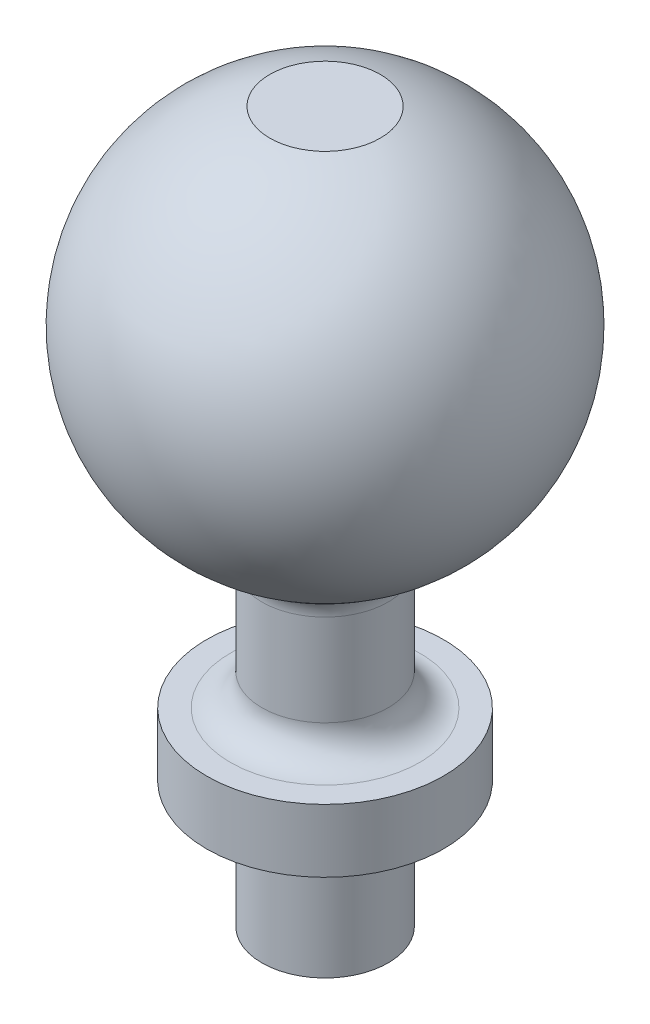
ISO-10303-21;
HEADER;
FILE_DESCRIPTION(('STEP AP214'),'2;1');
FILE_NAME('part.step','',(''),(''),'','','');
FILE_SCHEMA(('AUTOMOTIVE_DESIGN { 1 0 10303 214 1 1 1 1 }'));
ENDSEC;
DATA;
#1=APPLICATION_CONTEXT('core data for automotive mechanical design processes');
#2=APPLICATION_PROTOCOL_DEFINITION('international standard','automotive_design',2000,#1);
#3=PRODUCT_CONTEXT('',#1,'mechanical');
#4=PRODUCT('Part','Part','',(#3));
#5=PRODUCT_RELATED_PRODUCT_CATEGORY('part','',(#4));
#6=PRODUCT_DEFINITION_FORMATION('','',#4);
#7=PRODUCT_DEFINITION_CONTEXT('part definition',#1,'design');
#8=PRODUCT_DEFINITION('design','',#6,#7);
#9=PRODUCT_DEFINITION_SHAPE('','',#8);
#10=(LENGTH_UNIT() NAMED_UNIT(*) SI_UNIT(.MILLI.,.METRE.));
#11=(NAMED_UNIT(*) PLANE_ANGLE_UNIT() SI_UNIT($,.RADIAN.));
#12=(NAMED_UNIT(*) SI_UNIT($,.STERADIAN.) SOLID_ANGLE_UNIT());
#13=UNCERTAINTY_MEASURE_WITH_UNIT(LENGTH_MEASURE(1.E-05),#10,'distance_accuracy_value','');
#14=(GEOMETRIC_REPRESENTATION_CONTEXT(3) GLOBAL_UNCERTAINTY_ASSIGNED_CONTEXT((#13)) GLOBAL_UNIT_ASSIGNED_CONTEXT((#10,
#11,#12)) REPRESENTATION_CONTEXT('',''));
#15=CARTESIAN_POINT('',(0.,0.,0.));
#16=DIRECTION('',(0.,0.,1.));
#17=DIRECTION('',(1.,0.,0.));
#18=AXIS2_PLACEMENT_3D('',#15,#16,#17);
#19=CARTESIAN_POINT('',(4.,0.,0.));
#20=DIRECTION('',(0.,-1.,0.));
#21=DIRECTION('',(0.,0.,-1.));
#22=AXIS2_PLACEMENT_3D('',#19,#20,#21);
#23=PLANE('',#22);
#24=CARTESIAN_POINT('',(0.,0.,0.));
#25=DIRECTION('',(0.,1.,0.));
#26=DIRECTION('',(0.,0.,1.));
#27=AXIS2_PLACEMENT_3D('',#24,#25,#26);
#28=CIRCLE('',#27,4.);
#29=CARTESIAN_POINT('',(0.,0.,4.));
#30=VERTEX_POINT('',#29);
#31=EDGE_CURVE('E10',#30,#30,#28,.T.);
#32=ORIENTED_EDGE('',*,*,#31,.F.);
#33=EDGE_LOOP('',(#32));
#34=FACE_BOUND('',#33,.T.);
#35=ADVANCED_FACE('F30',(#34),#23,.T.);
#36=CARTESIAN_POINT('',(0.,0.,0.));
#37=DIRECTION('',(0.,1.,0.));
#38=DIRECTION('',(0.,0.,1.));
#39=AXIS2_PLACEMENT_3D('',#36,#37,#38);
#40=CYLINDRICAL_SURFACE('',#39,4.);
#41=ORIENTED_EDGE('',*,*,#31,.T.);
#42=EDGE_LOOP('',(#41));
#43=FACE_BOUND('',#42,.T.);
#44=CARTESIAN_POINT('',(0.,8.,0.));
#45=DIRECTION('',(0.,1.,0.));
#46=DIRECTION('',(0.,0.,1.));
#47=AXIS2_PLACEMENT_3D('',#44,#45,#46);
#48=CIRCLE('',#47,4.);
#49=CARTESIAN_POINT('',(0.,8.,4.));
#50=VERTEX_POINT('',#49);
#51=EDGE_CURVE('E36',#50,#50,#48,.T.);
#52=ORIENTED_EDGE('',*,*,#51,.F.);
#53=EDGE_LOOP('',(#52));
#54=FACE_BOUND('',#53,.T.);
#55=ADVANCED_FACE('F85',(#43,#54),#40,.T.);
#56=CARTESIAN_POINT('',(7.5,8.,0.));
#57=DIRECTION('',(0.,-1.,0.));
#58=DIRECTION('',(0.,0.,-1.));
#59=AXIS2_PLACEMENT_3D('',#56,#57,#58);
#60=PLANE('',#59);
#61=ORIENTED_EDGE('',*,*,#51,.T.);
#62=EDGE_LOOP('',(#61));
#63=FACE_BOUND('',#62,.T.);
#64=CARTESIAN_POINT('',(0.,8.,0.));
#65=DIRECTION('',(0.,1.,0.));
#66=DIRECTION('',(0.,0.,1.));
#67=AXIS2_PLACEMENT_3D('',#64,#65,#66);
#68=CIRCLE('',#67,7.5);
#69=CARTESIAN_POINT('',(0.,8.,7.5));
#70=VERTEX_POINT('',#69);
#71=EDGE_CURVE('E40',#70,#70,#68,.T.);
#72=ORIENTED_EDGE('',*,*,#71,.F.);
#73=EDGE_LOOP('',(#72));
#74=FACE_BOUND('',#73,.T.);
#75=ADVANCED_FACE('F90',(#63,#74),#60,.T.);
#76=CARTESIAN_POINT('',(0.,0.,0.));
#77=DIRECTION('',(0.,1.,0.));
#78=DIRECTION('',(0.,0.,1.));
#79=AXIS2_PLACEMENT_3D('',#76,#77,#78);
#80=CYLINDRICAL_SURFACE('',#79,7.5);
#81=ORIENTED_EDGE('',*,*,#71,.T.);
#82=EDGE_LOOP('',(#81));
#83=FACE_BOUND('',#82,.T.);
#84=CARTESIAN_POINT('',(0.,12.,0.));
#85=DIRECTION('',(0.,1.,0.));
#86=DIRECTION('',(0.,0.,1.));
#87=AXIS2_PLACEMENT_3D('',#84,#85,#86);
#88=CIRCLE('',#87,7.5);
#89=CARTESIAN_POINT('',(0.,12.,7.5));
#90=VERTEX_POINT('',#89);
#91=EDGE_CURVE('E44',#90,#90,#88,.T.);
#92=ORIENTED_EDGE('',*,*,#91,.F.);
#93=EDGE_LOOP('',(#92));
#94=FACE_BOUND('',#93,.T.);
#95=ADVANCED_FACE('F94',(#83,#94),#80,.T.);
#96=CARTESIAN_POINT('',(6.,12.,0.));
#97=DIRECTION('',(0.,1.,0.));
#98=DIRECTION('',(0.,0.,1.));
#99=AXIS2_PLACEMENT_3D('',#96,#97,#98);
#100=PLANE('',#99);
#101=ORIENTED_EDGE('',*,*,#91,.T.);
#102=EDGE_LOOP('',(#101));
#103=FACE_BOUND('',#102,.T.);
#104=CARTESIAN_POINT('',(0.,12.,0.));
#105=DIRECTION('',(0.,1.,0.));
#106=DIRECTION('',(0.,0.,1.));
#107=AXIS2_PLACEMENT_3D('',#104,#105,#106);
#108=CIRCLE('',#107,6.);
#109=CARTESIAN_POINT('',(0.,12.,6.));
#110=VERTEX_POINT('',#109);
#111=EDGE_CURVE('E49',#110,#110,#108,.T.);
#112=ORIENTED_EDGE('',*,*,#111,.F.);
#113=EDGE_LOOP('',(#112));
#114=FACE_BOUND('',#113,.T.);
#115=ADVANCED_FACE('F100',(#103,#114),#100,.T.);
#116=CARTESIAN_POINT('',(0.,14.,0.));
#117=DIRECTION('',(0.,1.,0.));
#118=DIRECTION('',(0.,0.,1.));
#119=AXIS2_PLACEMENT_3D('',#116,#117,#118);
#120=TOROIDAL_SURFACE('',#119,6.,2.);
#121=ORIENTED_EDGE('',*,*,#111,.T.);
#122=EDGE_LOOP('',(#121));
#123=FACE_BOUND('',#122,.T.);
#124=CARTESIAN_POINT('',(0.,14.,0.));
#125=DIRECTION('',(0.,1.,0.));
#126=DIRECTION('',(0.,0.,1.));
#127=AXIS2_PLACEMENT_3D('',#124,#125,#126);
#128=CIRCLE('',#127,4.);
#129=CARTESIAN_POINT('',(0.,14.,4.));
#130=VERTEX_POINT('',#129);
#131=EDGE_CURVE('E52',#130,#130,#128,.T.);
#132=ORIENTED_EDGE('',*,*,#131,.F.);
#133=EDGE_LOOP('',(#132));
#134=FACE_BOUND('',#133,.T.);
#135=ADVANCED_FACE('F81',(#123,#134),#120,.F.);
#136=CARTESIAN_POINT('',(0.,0.,0.));
#137=DIRECTION('',(0.,1.,0.));
#138=DIRECTION('',(0.,0.,1.));
#139=AXIS2_PLACEMENT_3D('',#136,#137,#138);
#140=CYLINDRICAL_SURFACE('',#139,4.);
#141=CARTESIAN_POINT('',(0.,19.7996212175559,0.));
#142=DIRECTION('',(0.,1.,0.));
#143=DIRECTION('',(0.,0.,1.));
#144=AXIS2_PLACEMENT_3D('',#141,#142,#143);
#145=CIRCLE('',#144,4.);
#146=CARTESIAN_POINT('',(0.,19.7996212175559,4.));
#147=VERTEX_POINT('',#146);
#148=EDGE_CURVE('E55',#147,#147,#145,.T.);
#149=ORIENTED_EDGE('',*,*,#148,.F.);
#150=EDGE_LOOP('',(#149));
#151=FACE_BOUND('',#150,.T.);
#152=ORIENTED_EDGE('',*,*,#131,.T.);
#153=EDGE_LOOP('',(#152));
#154=FACE_BOUND('',#153,.T.);
#155=ADVANCED_FACE('F75',(#151,#154),#140,.T.);
#156=CARTESIAN_POINT('',(0.,19.7996212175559,0.));
#157=DIRECTION('',(0.,1.,0.));
#158=DIRECTION('',(0.,0.,1.));
#159=AXIS2_PLACEMENT_3D('',#156,#157,#158);
#160=TOROIDAL_SURFACE('',#159,6.,2.);
#161=ORIENTED_EDGE('',*,*,#148,.T.);
#162=EDGE_LOOP('',(#161));
#163=FACE_BOUND('',#162,.T.);
#164=CARTESIAN_POINT('',(0.,21.6203631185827,0.));
#165=DIRECTION('',(0.,1.,0.));
#166=DIRECTION('',(0.,0.,1.));
#167=AXIS2_PLACEMENT_3D('',#164,#165,#166);
#168=CIRCLE('',#167,5.17241379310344);
#169=CARTESIAN_POINT('',(5.17241379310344,21.6203631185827,0.));
#170=VERTEX_POINT('',#169);
#171=EDGE_CURVE('E58',#170,#170,#168,.T.);
#172=ORIENTED_EDGE('',*,*,#171,.F.);
#173=EDGE_LOOP('',(#172));
#174=FACE_BOUND('',#173,.T.);
#175=ADVANCED_FACE('F70',(#163,#174),#160,.F.);
#176=CARTESIAN_POINT('',(0.,33.,0.));
#177=DIRECTION('',(0.,1.,0.));
#178=DIRECTION('',(1.,0.,0.));
#179=AXIS2_PLACEMENT_3D('',#176,#177,#178);
#180=SPHERICAL_SURFACE('',#179,12.5);
#181=CARTESIAN_POINT('',(0.,45.,0.));
#182=DIRECTION('',(0.,1.,0.));
#183=DIRECTION('',(0.,0.,1.));
#184=AXIS2_PLACEMENT_3D('',#181,#182,#183);
#185=CIRCLE('',#184,3.49999999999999);
#186=CARTESIAN_POINT('',(3.5,45.,0.));
#187=VERTEX_POINT('',#186);
#188=EDGE_CURVE('E61',#187,#187,#185,.T.);
#189=CARTESIAN_POINT('',(3.5,45.,0.));
#190=CARTESIAN_POINT('',(3.65194935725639,44.9556830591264,0.));
#191=CARTESIAN_POINT('',(3.80305599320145,44.9084771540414,0.));
#192=CARTESIAN_POINT('',(4.10336796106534,44.8083620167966,0.));
#193=CARTESIAN_POINT('',(4.25257329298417,44.7554527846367,0.));
#194=CARTESIAN_POINT('',(4.54886679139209,44.6440055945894,0.));
#195=CARTESIAN_POINT('',(4.69595495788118,44.5854676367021,0.));
#196=CARTESIAN_POINT('',(4.9878020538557,44.4628479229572,0.));
#197=CARTESIAN_POINT('',(5.13256098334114,44.3987661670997,0.));
#198=CARTESIAN_POINT('',(5.41954069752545,44.2651511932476,0.));
#199=CARTESIAN_POINT('',(5.56176148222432,44.1956179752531,0.));
#200=CARTESIAN_POINT('',(5.84345971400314,44.0512004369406,0.));
#201=CARTESIAN_POINT('',(5.98293716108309,43.9763161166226,0.));
#202=CARTESIAN_POINT('',(6.25894746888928,43.8213044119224,0.));
#203=CARTESIAN_POINT('',(6.39548032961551,43.7411770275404,0.));
#204=CARTESIAN_POINT('',(6.66540446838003,43.5757948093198,0.));
#205=CARTESIAN_POINT('',(6.79879574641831,43.4905399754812,0.));
#206=CARTESIAN_POINT('',(7.06224425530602,43.3150258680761,0.));
#207=CARTESIAN_POINT('',(7.19230148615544,43.2247665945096,0.));
#208=CARTESIAN_POINT('',(7.44889424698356,43.0393738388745,0.));
#209=CARTESIAN_POINT('',(7.57542977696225,42.944240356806,0.));
#210=CARTESIAN_POINT('',(7.82479656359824,42.7492364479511,0.));
#211=CARTESIAN_POINT('',(7.94762782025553,42.6493660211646,0.));
#212=CARTESIAN_POINT('',(8.18940883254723,42.445032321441,0.));
#213=CARTESIAN_POINT('',(8.30835858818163,42.340569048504,0.));
#214=CARTESIAN_POINT('',(8.54220497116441,42.1272003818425,0.));
#215=CARTESIAN_POINT('',(8.65710159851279,42.0182949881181,0.));
#216=CARTESIAN_POINT('',(8.88267594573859,41.796199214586,0.));
#217=CARTESIAN_POINT('',(8.99335366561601,41.6830088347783,0.));
#218=CARTESIAN_POINT('',(9.21033050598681,41.4525064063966,0.));
#219=CARTESIAN_POINT('',(9.31662962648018,41.3351943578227,0.));
#220=CARTESIAN_POINT('',(9.52469589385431,41.0966178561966,0.));
#221=CARTESIAN_POINT('',(9.62646304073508,40.9753534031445,0.));
#222=CARTESIAN_POINT('',(9.82531852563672,40.7290470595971,0.));
#223=CARTESIAN_POINT('',(9.92240686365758,40.6040051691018,0.));
#224=CARTESIAN_POINT('',(10.1117646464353,40.3503243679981,0.));
#225=CARTESIAN_POINT('',(10.2040340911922,40.2216854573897,0.));
#226=CARTESIAN_POINT('',(10.3836209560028,39.9609962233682,0.));
#227=CARTESIAN_POINT('',(10.4709383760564,39.8289458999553,0.));
#228=CARTESIAN_POINT('',(10.6404952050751,39.5616243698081,0.));
#229=CARTESIAN_POINT('',(10.7227346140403,39.4263531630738,0.));
#230=CARTESIAN_POINT('',(10.8820167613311,39.152785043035,0.));
#231=CARTESIAN_POINT('',(10.9590594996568,39.0144881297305,0.));
#232=CARTESIAN_POINT('',(11.1078371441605,38.7350681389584,0.));
#233=CARTESIAN_POINT('',(11.1795720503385,38.5939450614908,0.));
#234=CARTESIAN_POINT('',(11.3176305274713,38.3090763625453,0.));
#235=CARTESIAN_POINT('',(11.383954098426,38.1653307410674,0.));
#236=CARTESIAN_POINT('',(11.5110942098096,37.8754243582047,0.));
#237=CARTESIAN_POINT('',(11.5719107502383,37.72926359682,0.));
#238=CARTESIAN_POINT('',(11.6879490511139,37.4347378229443,0.));
#239=CARTESIAN_POINT('',(11.7431708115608,37.2863728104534,0.));
#240=CARTESIAN_POINT('',(11.8479398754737,36.9876526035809,0.));
#241=CARTESIAN_POINT('',(11.8974871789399,36.8372974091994,0.));
#242=CARTESIAN_POINT('',(11.9908358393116,36.5348137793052,0.));
#243=CARTESIAN_POINT('',(12.0346371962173,36.3826853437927,0.));
#244=CARTESIAN_POINT('',(12.1164307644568,36.0768747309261,0.));
#245=CARTESIAN_POINT('',(12.1544229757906,35.9231925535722,0.));
#246=CARTESIAN_POINT('',(12.2245434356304,35.614496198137,0.));
#247=CARTESIAN_POINT('',(12.2566716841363,35.4594820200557,0.));
#248=CARTESIAN_POINT('',(12.315017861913,35.1483453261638,0.));
#249=CARTESIAN_POINT('',(12.3412357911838,34.9922228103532,0.));
#250=CARTESIAN_POINT('',(12.387723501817,34.6790947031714,0.));
#251=CARTESIAN_POINT('',(12.4079932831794,34.5220891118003,0.));
#252=CARTESIAN_POINT('',(12.4425554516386,34.2074213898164,0.));
#253=CARTESIAN_POINT('',(12.4568478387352,34.0497592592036,0.));
#254=CARTESIAN_POINT('',(12.4794345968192,33.7340059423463,0.));
#255=CARTESIAN_POINT('',(12.4877289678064,33.5759147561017,0.));
#256=CARTESIAN_POINT('',(12.4983077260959,33.2595314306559,0.));
#257=CARTESIAN_POINT('',(12.5005921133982,33.1012392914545,0.));
#258=CARTESIAN_POINT('',(12.4991476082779,32.784682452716,0.));
#259=CARTESIAN_POINT('',(12.4954187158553,32.6264177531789,0.));
#260=CARTESIAN_POINT('',(12.4819530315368,32.3101441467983,0.));
#261=CARTESIAN_POINT('',(12.4722162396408,32.1521352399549,0.));
#262=CARTESIAN_POINT('',(12.4467488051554,31.8366012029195,0.));
#263=CARTESIAN_POINT('',(12.431018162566,31.6790760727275,0.));
#264=CARTESIAN_POINT('',(12.3935857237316,31.3647368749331,0.));
#265=CARTESIAN_POINT('',(12.3718839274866,31.2079228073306,0.));
#266=CARTESIAN_POINT('',(12.3225404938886,30.8952319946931,0.));
#267=CARTESIAN_POINT('',(12.2948988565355,30.7393552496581,0.));
#268=CARTESIAN_POINT('',(12.2337156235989,30.4287639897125,0.));
#269=CARTESIAN_POINT('',(12.2001740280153,30.274049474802,0.));
#270=CARTESIAN_POINT('',(12.1272392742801,29.9660059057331,0.));
#271=CARTESIAN_POINT('',(12.0878461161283,29.8126768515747,0.));
#272=CARTESIAN_POINT('',(12.0032650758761,29.5076254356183,0.));
#273=CARTESIAN_POINT('',(11.9580771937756,29.3559030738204,0.));
#274=CARTESIAN_POINT('',(11.861971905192,29.0542839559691,0.));
#275=CARTESIAN_POINT('',(11.8110544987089,28.9043871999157,0.));
#276=CARTESIAN_POINT('',(11.7035636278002,28.6066355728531,0.));
#277=CARTESIAN_POINT('',(11.6469901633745,28.4587807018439,0.));
#278=CARTESIAN_POINT('',(11.5282688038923,28.1653261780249,0.));
#279=CARTESIAN_POINT('',(11.4661209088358,28.0197265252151,0.));
#280=CARTESIAN_POINT('',(11.3363403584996,27.7309925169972,0.));
#281=CARTESIAN_POINT('',(11.26870770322,27.5878581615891,0.));
#282=CARTESIAN_POINT('',(11.1280552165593,27.3042612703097,0.));
#283=CARTESIAN_POINT('',(11.0550353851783,27.1637987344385,0.));
#284=CARTESIAN_POINT('',(10.9037139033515,26.8857481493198,0.));
#285=CARTESIAN_POINT('',(10.8254122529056,26.7481601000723,0.));
#286=CARTESIAN_POINT('',(10.6636401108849,26.4760570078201,0.));
#287=CARTESIAN_POINT('',(10.5801696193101,26.3415419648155,0.));
#288=CARTESIAN_POINT('',(10.4081802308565,26.0757789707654,0.));
#289=CARTESIAN_POINT('',(10.3196613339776,25.9445310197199,0.));
#290=CARTESIAN_POINT('',(10.1377028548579,25.6854915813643,0.));
#291=CARTESIAN_POINT('',(10.0442632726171,25.5577000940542,0.));
#292=CARTESIAN_POINT('',(9.85259824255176,25.3057579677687,0.));
#293=CARTESIAN_POINT('',(9.75437279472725,25.1816073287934,0.));
#294=CARTESIAN_POINT('',(9.55327775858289,24.9371260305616,0.));
#295=CARTESIAN_POINT('',(9.45040817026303,24.8167953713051,0.));
#296=CARTESIAN_POINT('',(9.24017327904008,24.5801276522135,0.));
#297=CARTESIAN_POINT('',(9.13280797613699,24.4637905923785,0.));
#298=CARTESIAN_POINT('',(8.91373656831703,24.2352779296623,0.));
#299=CARTESIAN_POINT('',(8.80203046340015,24.1231023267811,0.));
#300=CARTESIAN_POINT('',(8.57443862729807,23.9030744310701,0.));
#301=CARTESIAN_POINT('',(8.45855289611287,23.7952221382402,0.));
#302=CARTESIAN_POINT('',(8.22276901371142,23.5839964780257,0.));
#303=CARTESIAN_POINT('',(8.10287086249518,23.480623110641,0.));
#304=CARTESIAN_POINT('',(7.85923513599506,23.2785044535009,0.));
#305=CARTESIAN_POINT('',(7.7354975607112,23.1797591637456,0.));
#306=CARTESIAN_POINT('',(7.48436152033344,22.9870391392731,0.));
#307=CARTESIAN_POINT('',(7.35696305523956,22.8930644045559,0.));
#308=CARTESIAN_POINT('',(7.09868905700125,22.7100210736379,0.));
#309=CARTESIAN_POINT('',(6.96781352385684,22.620952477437,0.));
#310=CARTESIAN_POINT('',(6.70277420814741,22.4478499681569,0.));
#311=CARTESIAN_POINT('',(6.56861042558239,22.3638160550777,0.));
#312=CARTESIAN_POINT('',(6.29718824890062,22.2009040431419,0.));
#313=CARTESIAN_POINT('',(6.15992985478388,22.1220259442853,0.));
#314=CARTESIAN_POINT('',(5.88251627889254,21.9695398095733,0.));
#315=CARTESIAN_POINT('',(5.74236109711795,21.8959317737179,0.));
#316=CARTESIAN_POINT('',(5.45935699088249,21.7540903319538,0.));
#317=CARTESIAN_POINT('',(5.31650806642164,21.6858569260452,0.));
#318=CARTESIAN_POINT('',(5.17241379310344,21.6203631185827,0.));
#319=B_SPLINE_CURVE_WITH_KNOTS('',3,(#189,#190,#191,#192,#193,#194,#195,#196,#197,#198,#199,
#200,#201,#202,#203,#204,#205,#206,#207,#208,#209,#210,#211,#212,#213,#214,#215,#216,#217,#218,
#219,#220,#221,#222,#223,#224,#225,#226,#227,#228,#229,#230,#231,#232,#233,#234,#235,#236,#237,
#238,#239,#240,#241,#242,#243,#244,#245,#246,#247,#248,#249,#250,#251,#252,#253,#254,#255,#256,
#257,#258,#259,#260,#261,#262,#263,#264,#265,#266,#267,#268,#269,#270,#271,#272,#273,#274,#275,
#276,#277,#278,#279,#280,#281,#282,#283,#284,#285,#286,#287,#288,#289,#290,#291,#292,#293,#294,
#295,#296,#297,#298,#299,#300,#301,#302,#303,#304,#305,#306,#307,#308,#309,#310,#311,#312,#313,
#314,#315,#316,#317,#318),.UNSPECIFIED.,.F.,.F.,(4,2,2,2,2,2,2,2,2,2,2,2,2,2,2,2,2,2,2,2,2,2,2,
2,2,2,2,2,2,2,2,2,2,2,2,2,2,2,2,2,2,2,2,2,2,2,2,2,2,2,2,2,2,2,2,2,2,2,2,2,2,2,2,2,4),(0.,
0.474811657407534,0.949623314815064,1.4244349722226,1.89924662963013,2.37405828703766,
2.84886994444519,3.32368160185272,3.79849325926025,4.27330491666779,4.74811657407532,
5.22292823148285,5.69773988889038,6.17255154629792,6.64736320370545,7.12217486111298,
7.59698651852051,8.07179817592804,8.54660983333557,9.02142149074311,9.49623314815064,
9.97104480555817,10.4458564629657,10.9206681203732,11.3954797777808,11.8702914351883,
12.3451030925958,12.8199147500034,13.2947264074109,13.7695380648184,14.244349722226,
14.7191613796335,15.193973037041,15.6687846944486,16.1435963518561,16.6184080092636,
17.0932196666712,17.5680313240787,18.0428429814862,18.5176546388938,18.9924662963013,
19.4672779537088,19.9420896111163,20.4169012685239,20.8917129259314,21.3665245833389,
21.8413362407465,22.316147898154,22.7909595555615,23.2657712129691,23.7405828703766,
24.2153945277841,24.6902061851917,25.1650178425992,25.6398295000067,26.1146411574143,
26.5894528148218,27.0642644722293,27.5390761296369,28.0138877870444,28.4886994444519,
28.9635111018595,29.438322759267,29.9131344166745,30.387946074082),.UNSPECIFIED.);
#320=EDGE_CURVE('BSEAM67',#187,#170,#319,.T.);
#321=ORIENTED_EDGE('',*,*,#188,.F.);
#322=ORIENTED_EDGE('',*,*,#171,.T.);
#323=ORIENTED_EDGE('',*,*,#320,.T.);
#324=ORIENTED_EDGE('',*,*,#320,.F.);
#325=EDGE_LOOP('',(#321,#323,#322,#324));
#326=FACE_BOUND('',#325,.T.);
#327=ADVANCED_FACE('F67',(#326),#180,.T.);
#328=CARTESIAN_POINT('',(0.,45.,0.));
#329=DIRECTION('',(0.,1.,0.));
#330=DIRECTION('',(0.,0.,1.));
#331=AXIS2_PLACEMENT_3D('',#328,#329,#330);
#332=PLANE('',#331);
#333=ORIENTED_EDGE('',*,*,#188,.T.);
#334=EDGE_LOOP('',(#333));
#335=FACE_BOUND('',#334,.T.);
#336=ADVANCED_FACE('F65',(#335),#332,.T.);
#337=CLOSED_SHELL('',(#35,#55,#75,#95,#115,#135,#155,#175,#327,#336));
#338=MANIFOLD_SOLID_BREP('B2',#337);
#339=ADVANCED_BREP_SHAPE_REPRESENTATION('',(#18,#338),#14);
#340=SHAPE_DEFINITION_REPRESENTATION(#9,#339);
ENDSEC;
END-ISO-10303-21;
